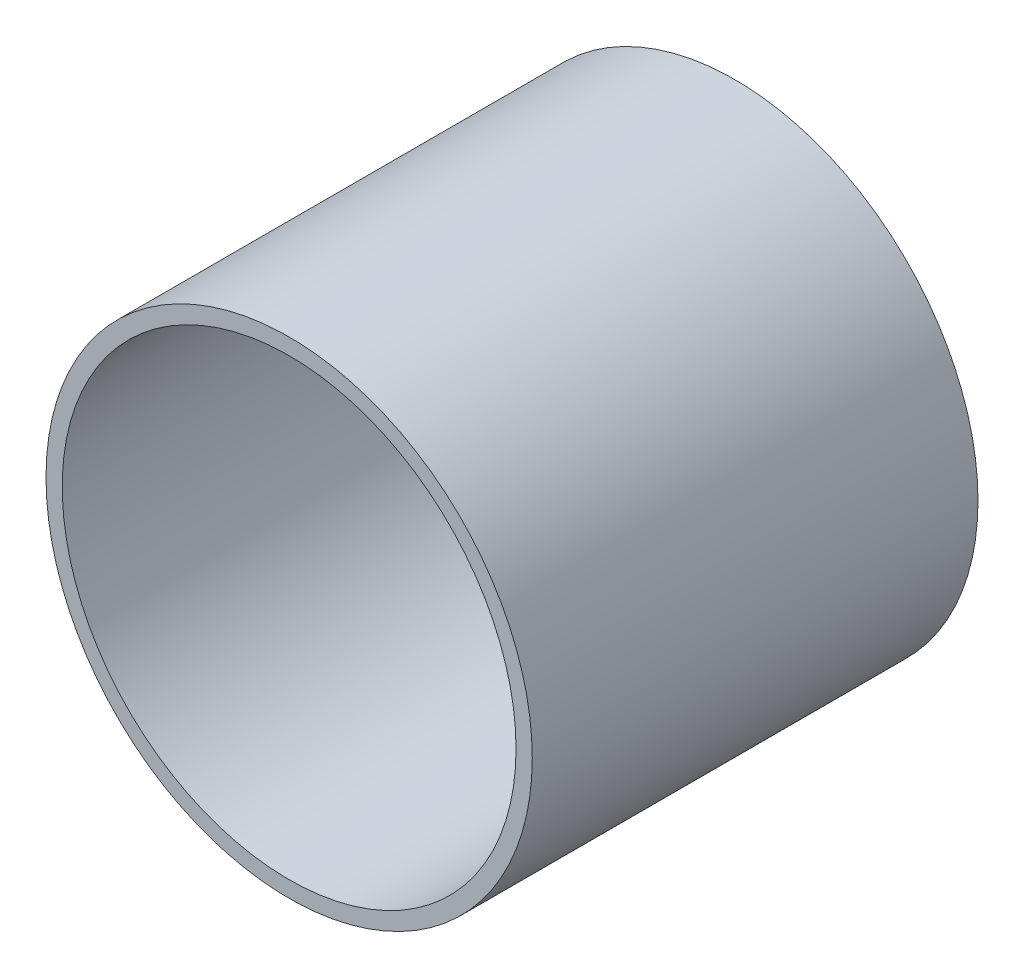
ISO-10303-21;
HEADER;
FILE_DESCRIPTION(('STEP AP214'),'2;1');
FILE_NAME('part.step','',(''),(''),'','','');
FILE_SCHEMA(('AUTOMOTIVE_DESIGN { 1 0 10303 214 1 1 1 1 }'));
ENDSEC;
DATA;
#1=APPLICATION_CONTEXT('core data for automotive mechanical design processes');
#2=APPLICATION_PROTOCOL_DEFINITION('international standard','automotive_design',2000,#1);
#3=PRODUCT_CONTEXT('',#1,'mechanical');
#4=PRODUCT('Part','Part','',(#3));
#5=PRODUCT_RELATED_PRODUCT_CATEGORY('part','',(#4));
#6=PRODUCT_DEFINITION_FORMATION('','',#4);
#7=PRODUCT_DEFINITION_CONTEXT('part definition',#1,'design');
#8=PRODUCT_DEFINITION('design','',#6,#7);
#9=PRODUCT_DEFINITION_SHAPE('','',#8);
#10=(LENGTH_UNIT() NAMED_UNIT(*) SI_UNIT(.MILLI.,.METRE.));
#11=(NAMED_UNIT(*) PLANE_ANGLE_UNIT() SI_UNIT($,.RADIAN.));
#12=(NAMED_UNIT(*) SI_UNIT($,.STERADIAN.) SOLID_ANGLE_UNIT());
#13=UNCERTAINTY_MEASURE_WITH_UNIT(LENGTH_MEASURE(1.E-05),#10,'distance_accuracy_value','');
#14=(GEOMETRIC_REPRESENTATION_CONTEXT(3) GLOBAL_UNCERTAINTY_ASSIGNED_CONTEXT((#13)) GLOBAL_UNIT_ASSIGNED_CONTEXT((#10,
#11,#12)) REPRESENTATION_CONTEXT('',''));
#15=CARTESIAN_POINT('',(0.,0.,0.));
#16=DIRECTION('',(0.,0.,1.));
#17=DIRECTION('',(1.,0.,0.));
#18=AXIS2_PLACEMENT_3D('',#15,#16,#17);
#19=CARTESIAN_POINT('',(0.,0.,5.5));
#20=DIRECTION('',(0.,0.,1.));
#21=DIRECTION('',(1.,0.,0.));
#22=AXIS2_PLACEMENT_3D('',#19,#20,#21);
#23=PLANE('',#22);
#24=CARTESIAN_POINT('',(0.,0.,5.5));
#25=DIRECTION('',(0.,0.,1.));
#26=DIRECTION('',(1.,0.,0.));
#27=AXIS2_PLACEMENT_3D('',#24,#25,#26);
#28=CIRCLE('',#27,3.);
#29=CARTESIAN_POINT('',(3.,0.,5.5));
#30=VERTEX_POINT('',#29);
#31=EDGE_CURVE('E10',#30,#30,#28,.T.);
#32=ORIENTED_EDGE('',*,*,#31,.T.);
#33=EDGE_LOOP('',(#32));
#34=FACE_BOUND('',#33,.T.);
#35=CARTESIAN_POINT('',(0.,0.,5.5));
#36=DIRECTION('',(0.,0.,1.));
#37=DIRECTION('',(1.,0.,0.));
#38=AXIS2_PLACEMENT_3D('',#35,#36,#37);
#39=CIRCLE('',#38,2.8);
#40=CARTESIAN_POINT('',(2.8,0.,5.5));
#41=VERTEX_POINT('',#40);
#42=EDGE_CURVE('E43',#41,#41,#39,.T.);
#43=ORIENTED_EDGE('',*,*,#42,.F.);
#44=EDGE_LOOP('',(#43));
#45=FACE_BOUND('',#44,.T.);
#46=ADVANCED_FACE('F32',(#34,#45),#23,.T.);
#47=CARTESIAN_POINT('',(0.,0.,0.));
#48=DIRECTION('',(0.,0.,1.));
#49=DIRECTION('',(1.,0.,0.));
#50=AXIS2_PLACEMENT_3D('',#47,#48,#49);
#51=PLANE('',#50);
#52=CARTESIAN_POINT('',(0.,0.,0.));
#53=DIRECTION('',(0.,0.,1.));
#54=DIRECTION('',(1.,0.,0.));
#55=AXIS2_PLACEMENT_3D('',#52,#53,#54);
#56=CIRCLE('',#55,3.);
#57=CARTESIAN_POINT('',(3.,0.,0.));
#58=VERTEX_POINT('',#57);
#59=EDGE_CURVE('E36',#58,#58,#56,.T.);
#60=ORIENTED_EDGE('',*,*,#59,.F.);
#61=EDGE_LOOP('',(#60));
#62=FACE_BOUND('',#61,.T.);
#63=CARTESIAN_POINT('',(0.,0.,0.));
#64=DIRECTION('',(0.,0.,1.));
#65=DIRECTION('',(1.,0.,0.));
#66=AXIS2_PLACEMENT_3D('',#63,#64,#65);
#67=CIRCLE('',#66,2.8);
#68=CARTESIAN_POINT('',(2.8,0.,0.));
#69=VERTEX_POINT('',#68);
#70=EDGE_CURVE('E45',#69,#69,#67,.T.);
#71=ORIENTED_EDGE('',*,*,#70,.T.);
#72=EDGE_LOOP('',(#71));
#73=FACE_BOUND('',#72,.T.);
#74=ADVANCED_FACE('F55',(#62,#73),#51,.F.);
#75=CARTESIAN_POINT('',(0.,0.,5.5));
#76=DIRECTION('',(0.,0.,-1.));
#77=DIRECTION('',(-1.,0.,0.));
#78=AXIS2_PLACEMENT_3D('',#75,#76,#77);
#79=CYLINDRICAL_SURFACE('',#78,3.);
#80=ORIENTED_EDGE('',*,*,#31,.F.);
#81=EDGE_LOOP('',(#80));
#82=FACE_BOUND('',#81,.T.);
#83=ORIENTED_EDGE('',*,*,#59,.T.);
#84=EDGE_LOOP('',(#83));
#85=FACE_BOUND('',#84,.T.);
#86=ADVANCED_FACE('F34',(#82,#85),#79,.T.);
#87=CARTESIAN_POINT('',(0.,0.,5.5));
#88=DIRECTION('',(0.,0.,-1.));
#89=DIRECTION('',(-1.,0.,0.));
#90=AXIS2_PLACEMENT_3D('',#87,#88,#89);
#91=CYLINDRICAL_SURFACE('',#90,2.8);
#92=ORIENTED_EDGE('',*,*,#42,.T.);
#93=EDGE_LOOP('',(#92));
#94=FACE_BOUND('',#93,.T.);
#95=ORIENTED_EDGE('',*,*,#70,.F.);
#96=EDGE_LOOP('',(#95));
#97=FACE_BOUND('',#96,.T.);
#98=ADVANCED_FACE('F51',(#94,#97),#91,.F.);
#99=CLOSED_SHELL('',(#46,#74,#86,#98));
#100=MANIFOLD_SOLID_BREP('B2',#99);
#101=ADVANCED_BREP_SHAPE_REPRESENTATION('',(#18,#100),#14);
#102=SHAPE_DEFINITION_REPRESENTATION(#9,#101);
ENDSEC;
END-ISO-10303-21;
